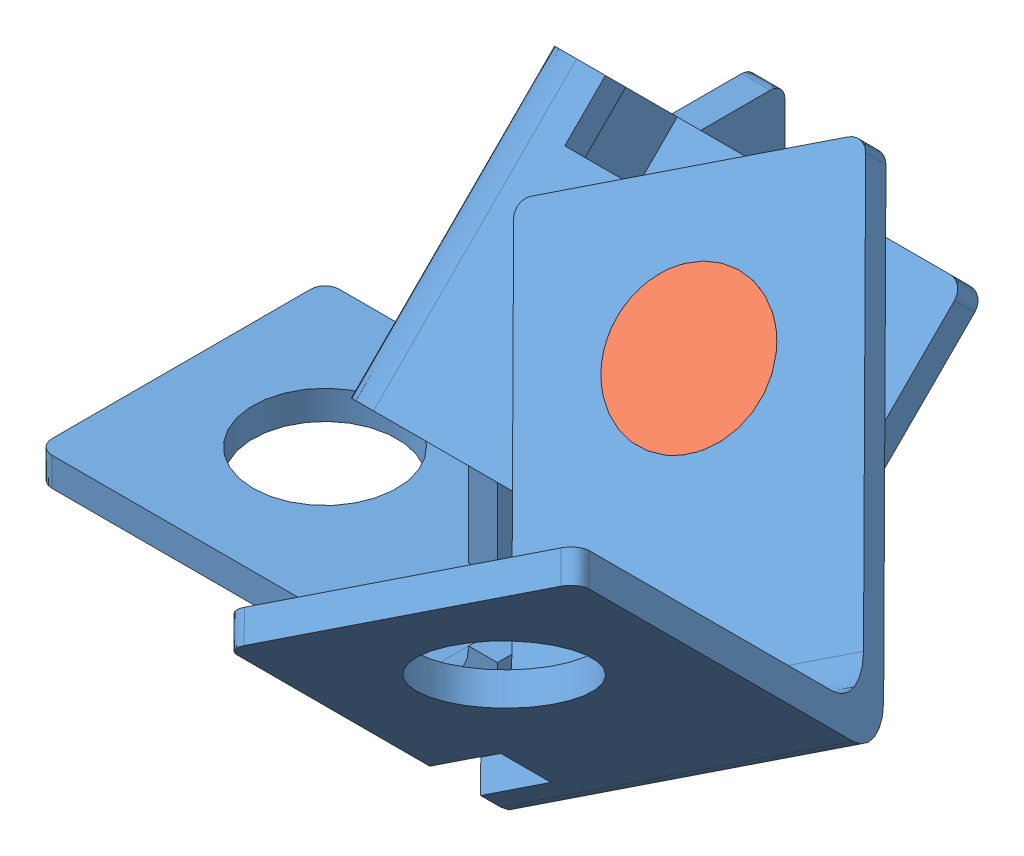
SolidWorks assembly assembly.SLDASM, configuration Default (file format 13000). Lengths in mm.
Overall size (73.81 67.32 68.42).
5 component instances, 2 part files, 11 mates.
Components (placement in the parent):
- bracket-1: bracket.SLDPRT [Default] at (0 0 -1) size (32 30 20)
- pin-1: pin.SLDPRT [Default] at (35 20 9) x (0 1 0) z (0 0 1) size (10 5 10)
- bracket-3: bracket.SLDPRT [Default] at (33 5.8579 9) x (0 0.707107 0.707107) z (0 0.707107 -0.707107) size (32 30 20)
- bracket-4: bracket.SLDPRT [Default] at (55.4558 46.1115 15.4154) x (0.573576 -0.579228 0.579228) z (-0.819152 -0.40558 0.40558) size (32 30 20)
- pin-3: pin.SLDPRT [Default] at (53 34.1421 23.1421) x (1 0 0) z (0 -0.707107 0.707107) size (10 5 10)
Mates (geometry in assembly coordinates):
- Coincident3: coincident: point of bracket-1
- Concentric3: concentric anti-aligned: cylinder of bracket-1 through (60 20 9) axis (-1 0 0) radius 5; cylinder of pin-1 through (30 20 9) axis (1 0 0) radius 5
- Coincident6: coincident aligned: plane of bracket-1 through (30 30 -1) normal (-1 0 0); plane of pin-1 through (30 20 9) normal (-1 0 0)
- Concentric4: concentric aligned: cylinder of pin-1 through (30 20 9) axis (1 0 0) radius 5; cylinder of bracket-3 through (22 20 9) axis (1 0 0) radius 5
- Coincident7: coincident aligned: plane of pin-1 through (35 20 9) normal (1 0 0); plane of bracket-3 through (35 5.8579 9) normal (1 0 0)
- Angle1: planar angle = 0.785398 rad aligned: line of bracket-1 through (32 29 19) axis (0 -1 0); line of bracket-3 through (33 26.364 29.5061) axis (0 -0.707107 -0.707107)
- Concentric5: concentric aligned: cylinder of bracket-3 through (53 55.3553 44.3553) axis (0 -0.707107 -0.707107) radius 5; cylinder of pin-3 through (53 37.6777 26.6777) axis (0 -0.707107 -0.707107) radius 5
- Coincident9: coincident aligned: plane of bracket-3 through (63 27.0711 30.2132) normal (0 -0.707107 -0.707107); plane of pin-3 through (53 34.1421 23.1421) normal (0 -0.707107 -0.707107)
- Concentric6: concentric anti-aligned: cylinder of bracket-4 through (53 28.4853 17.4853) axis (0 0.707107 0.707107) radius 5; cylinder of pin-3 through (53 37.6777 26.6777) axis (0 -0.707107 -0.707107) radius 5
- Coincident10: coincident aligned: plane of bracket-4 through (55.4558 47.5257 16.8296) normal (0 0.707107 0.707107); plane of pin-3 through (53 37.6777 26.6777) normal (0 0.707107 0.707107)
- Angle2: planar angle = 4.101524 rad aligned: line of bracket-4 through (39.6463 38.8349 25.5204) axis (0.573576 -0.579228 0.579228); line of bracket-3 through (62 28.4853 31.6274) axis (-1 0 0)
